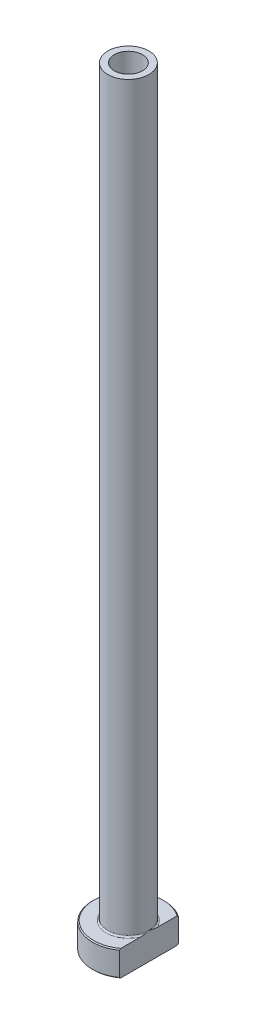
ISO-10303-21;
HEADER;
FILE_DESCRIPTION(('STEP AP214'),'2;1');
FILE_NAME('part.step','',(''),(''),'','','');
FILE_SCHEMA(('AUTOMOTIVE_DESIGN { 1 0 10303 214 1 1 1 1 }'));
ENDSEC;
DATA;
#1=APPLICATION_CONTEXT('core data for automotive mechanical design processes');
#2=APPLICATION_PROTOCOL_DEFINITION('international standard','automotive_design',2000,#1);
#3=PRODUCT_CONTEXT('',#1,'mechanical');
#4=PRODUCT('Part','Part','',(#3));
#5=PRODUCT_RELATED_PRODUCT_CATEGORY('part','',(#4));
#6=PRODUCT_DEFINITION_FORMATION('','',#4);
#7=PRODUCT_DEFINITION_CONTEXT('part definition',#1,'design');
#8=PRODUCT_DEFINITION('design','',#6,#7);
#9=PRODUCT_DEFINITION_SHAPE('','',#8);
#10=(LENGTH_UNIT() NAMED_UNIT(*) SI_UNIT(.MILLI.,.METRE.));
#11=(NAMED_UNIT(*) PLANE_ANGLE_UNIT() SI_UNIT($,.RADIAN.));
#12=(NAMED_UNIT(*) SI_UNIT($,.STERADIAN.) SOLID_ANGLE_UNIT());
#13=UNCERTAINTY_MEASURE_WITH_UNIT(LENGTH_MEASURE(1.E-05),#10,'distance_accuracy_value','');
#14=(GEOMETRIC_REPRESENTATION_CONTEXT(3) GLOBAL_UNCERTAINTY_ASSIGNED_CONTEXT((#13)) GLOBAL_UNIT_ASSIGNED_CONTEXT((#10,
#11,#12)) REPRESENTATION_CONTEXT('',''));
#15=CARTESIAN_POINT('',(0.,0.,0.));
#16=DIRECTION('',(0.,0.,1.));
#17=DIRECTION('',(1.,0.,0.));
#18=AXIS2_PLACEMENT_3D('',#15,#16,#17);
#19=CARTESIAN_POINT('',(0.,92.1876809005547,0.));
#20=DIRECTION('',(0.,1.,0.));
#21=DIRECTION('',(0.,0.,1.));
#22=AXIS2_PLACEMENT_3D('',#19,#20,#21);
#23=CYLINDRICAL_SURFACE('',#22,2.75);
#24=CARTESIAN_POINT('',(0.,150.,0.));
#25=DIRECTION('',(0.,1.,0.));
#26=DIRECTION('',(0.,0.,1.));
#27=AXIS2_PLACEMENT_3D('',#24,#25,#26);
#28=CIRCLE('',#27,2.75);
#29=CARTESIAN_POINT('',(0.,150.,2.75));
#30=VERTEX_POINT('',#29);
#31=EDGE_CURVE('E167',#30,#30,#28,.T.);
#32=ORIENTED_EDGE('',*,*,#31,.T.);
#33=EDGE_LOOP('',(#32));
#34=FACE_BOUND('',#33,.T.);
#35=CARTESIAN_POINT('',(0.,105.,0.));
#36=DIRECTION('',(0.,1.,0.));
#37=DIRECTION('',(0.,0.,1.));
#38=AXIS2_PLACEMENT_3D('',#35,#36,#37);
#39=CIRCLE('',#38,2.75);
#40=CARTESIAN_POINT('',(0.,105.,2.75));
#41=VERTEX_POINT('',#40);
#42=EDGE_CURVE('E170',#41,#41,#39,.T.);
#43=ORIENTED_EDGE('',*,*,#42,.F.);
#44=EDGE_LOOP('',(#43));
#45=FACE_BOUND('',#44,.T.);
#46=ADVANCED_FACE('F32',(#34,#45),#23,.F.);
#47=CARTESIAN_POINT('',(-2.75,150.,0.));
#48=DIRECTION('',(0.,1.,0.));
#49=DIRECTION('',(0.,0.,1.));
#50=AXIS2_PLACEMENT_3D('',#47,#48,#49);
#51=PLANE('',#50);
#52=CARTESIAN_POINT('',(0.,150.,0.));
#53=DIRECTION('',(0.,1.,0.));
#54=DIRECTION('',(0.,0.,1.));
#55=AXIS2_PLACEMENT_3D('',#52,#53,#54);
#56=CIRCLE('',#55,4.00000000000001);
#57=CARTESIAN_POINT('',(0.,150.,4.00000000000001));
#58=VERTEX_POINT('',#57);
#59=EDGE_CURVE('E174',#58,#58,#56,.T.);
#60=ORIENTED_EDGE('',*,*,#59,.T.);
#61=EDGE_LOOP('',(#60));
#62=FACE_BOUND('',#61,.T.);
#63=ORIENTED_EDGE('',*,*,#31,.F.);
#64=EDGE_LOOP('',(#63));
#65=FACE_BOUND('',#64,.T.);
#66=ADVANCED_FACE('F157',(#62,#65),#51,.T.);
#67=CARTESIAN_POINT('',(0.,92.1876809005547,0.));
#68=DIRECTION('',(0.,1.,0.));
#69=DIRECTION('',(0.,0.,1.));
#70=AXIS2_PLACEMENT_3D('',#67,#68,#69);
#71=CYLINDRICAL_SURFACE('',#70,4.);
#72=CARTESIAN_POINT('',(0.,5.3,0.));
#73=DIRECTION('',(0.,1.,0.));
#74=DIRECTION('',(0.,0.,1.));
#75=AXIS2_PLACEMENT_3D('',#72,#73,#74);
#76=CIRCLE('',#75,4.);
#77=CARTESIAN_POINT('',(4.,5.3,0.));
#78=VERTEX_POINT('',#77);
#79=EDGE_CURVE('E180',#78,#78,#76,.T.);
#80=ORIENTED_EDGE('',*,*,#79,.T.);
#81=EDGE_LOOP('',(#80));
#82=FACE_BOUND('',#81,.T.);
#83=ORIENTED_EDGE('',*,*,#59,.F.);
#84=EDGE_LOOP('',(#83));
#85=FACE_BOUND('',#84,.T.);
#86=ADVANCED_FACE('F162',(#82,#85),#71,.T.);
#87=CARTESIAN_POINT('',(-3.99999999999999,5.,0.));
#88=DIRECTION('',(0.,1.,0.));
#89=DIRECTION('',(0.,0.,1.));
#90=AXIS2_PLACEMENT_3D('',#87,#88,#89);
#91=PLANE('',#90);
#92=DIRECTION('',(0.,0.,1.));
#93=VECTOR('',#92,1.);
#94=CARTESIAN_POINT('',(4.,5.,0.));
#95=LINE('',#94,#93);
#96=CARTESIAN_POINT('',(4.,5.,-5.49909083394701));
#97=VERTEX_POINT('',#96);
#98=CARTESIAN_POINT('',(4.,5.,-1.57797338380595));
#99=VERTEX_POINT('',#98);
#100=EDGE_CURVE('E54',#97,#99,#95,.T.);
#101=ORIENTED_EDGE('',*,*,#100,.F.);
#102=CARTESIAN_POINT('',(0.,5.,0.));
#103=DIRECTION('',(0.,1.,0.));
#104=DIRECTION('',(0.,0.,1.));
#105=AXIS2_PLACEMENT_3D('',#102,#103,#104);
#106=CIRCLE('',#105,6.8);
#107=CARTESIAN_POINT('',(3.99999999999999,5.,5.49909083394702));
#108=VERTEX_POINT('',#107);
#109=EDGE_CURVE('E186',#97,#108,#106,.T.);
#110=ORIENTED_EDGE('',*,*,#109,.T.);
#111=CARTESIAN_POINT('',(4.,5.,1.57797338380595));
#112=VERTEX_POINT('',#111);
#113=EDGE_CURVE('E134',#112,#108,#95,.T.);
#114=ORIENTED_EDGE('',*,*,#113,.F.);
#115=CARTESIAN_POINT('',(0.,5.,0.));
#116=DIRECTION('',(0.,1.,0.));
#117=DIRECTION('',(0.,0.,1.));
#118=AXIS2_PLACEMENT_3D('',#115,#116,#117);
#119=CIRCLE('',#118,4.3);
#120=EDGE_CURVE('E183',#112,#99,#119,.F.);
#121=ORIENTED_EDGE('',*,*,#120,.T.);
#122=EDGE_LOOP('',(#101,#110,#114,#121));
#123=FACE_BOUND('',#122,.T.);
#124=ADVANCED_FACE('F197',(#123),#91,.T.);
#125=CARTESIAN_POINT('',(0.,92.1876809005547,0.));
#126=DIRECTION('',(0.,1.,0.));
#127=DIRECTION('',(0.,0.,1.));
#128=AXIS2_PLACEMENT_3D('',#125,#126,#127);
#129=CYLINDRICAL_SURFACE('',#128,6.99999999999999);
#130=DIRECTION('',(0.,-1.,0.));
#131=VECTOR('',#130,1.);
#132=CARTESIAN_POINT('',(3.99999999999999,150.,5.74456264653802));
#133=LINE('',#132,#131);
#134=CARTESIAN_POINT('',(3.99999999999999,4.8,5.74456264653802));
#135=VERTEX_POINT('',#134);
#136=CARTESIAN_POINT('',(3.99999999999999,0.200000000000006,5.74456264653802));
#137=VERTEX_POINT('',#136);
#138=EDGE_CURVE('E82',#135,#137,#133,.T.);
#139=ORIENTED_EDGE('',*,*,#138,.F.);
#140=CARTESIAN_POINT('',(0.,4.8,0.));
#141=DIRECTION('',(0.,1.,0.));
#142=DIRECTION('',(0.,0.,1.));
#143=AXIS2_PLACEMENT_3D('',#140,#141,#142);
#144=CIRCLE('',#143,6.99999999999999);
#145=CARTESIAN_POINT('',(4.,4.8,-5.74456264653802));
#146=VERTEX_POINT('',#145);
#147=EDGE_CURVE('E95',#135,#146,#144,.F.);
#148=ORIENTED_EDGE('',*,*,#147,.T.);
#149=DIRECTION('',(0.,-1.,0.));
#150=VECTOR('',#149,1.);
#151=CARTESIAN_POINT('',(4.,150.,-5.74456264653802));
#152=LINE('',#151,#150);
#153=CARTESIAN_POINT('',(4.,0.200000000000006,-5.74456264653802));
#154=VERTEX_POINT('',#153);
#155=EDGE_CURVE('E192',#146,#154,#152,.T.);
#156=ORIENTED_EDGE('',*,*,#155,.T.);
#157=CARTESIAN_POINT('',(0.,0.200000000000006,0.));
#158=DIRECTION('',(0.,-1.,0.));
#159=DIRECTION('',(0.,0.,-1.));
#160=AXIS2_PLACEMENT_3D('',#157,#158,#159);
#161=CIRCLE('',#160,6.99999999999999);
#162=EDGE_CURVE('E98',#154,#137,#161,.F.);
#163=ORIENTED_EDGE('',*,*,#162,.T.);
#164=EDGE_LOOP('',(#139,#148,#156,#163));
#165=FACE_BOUND('',#164,.T.);
#166=ADVANCED_FACE('F190',(#165),#129,.T.);
#167=CARTESIAN_POINT('',(-6.99999999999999,0.,0.));
#168=DIRECTION('',(0.,-1.,0.));
#169=DIRECTION('',(0.,0.,-1.));
#170=AXIS2_PLACEMENT_3D('',#167,#168,#169);
#171=PLANE('',#170);
#172=CARTESIAN_POINT('',(0.,0.,0.));
#173=DIRECTION('',(0.,-1.,0.));
#174=DIRECTION('',(0.,0.,-1.));
#175=AXIS2_PLACEMENT_3D('',#172,#173,#174);
#176=CIRCLE('',#175,3.49999999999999);
#177=CARTESIAN_POINT('',(0.,0.,-3.49999999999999));
#178=VERTEX_POINT('',#177);
#179=EDGE_CURVE('E40',#178,#178,#176,.F.);
#180=ORIENTED_EDGE('',*,*,#179,.T.);
#181=EDGE_LOOP('',(#180));
#182=FACE_BOUND('',#181,.T.);
#183=DIRECTION('',(0.,0.,-1.));
#184=VECTOR('',#183,1.);
#185=CARTESIAN_POINT('',(3.99999999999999,0.,5.74456264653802));
#186=LINE('',#185,#184);
#187=CARTESIAN_POINT('',(3.99999999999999,0.,5.49909083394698));
#188=VERTEX_POINT('',#187);
#189=CARTESIAN_POINT('',(4.,0.,-5.49909083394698));
#190=VERTEX_POINT('',#189);
#191=EDGE_CURVE('E47',#188,#190,#186,.T.);
#192=ORIENTED_EDGE('',*,*,#191,.F.);
#193=CARTESIAN_POINT('',(0.,0.,0.));
#194=DIRECTION('',(0.,-1.,0.));
#195=DIRECTION('',(0.,0.,-1.));
#196=AXIS2_PLACEMENT_3D('',#193,#194,#195);
#197=CIRCLE('',#196,6.79999999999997);
#198=EDGE_CURVE('E92',#188,#190,#197,.T.);
#199=ORIENTED_EDGE('',*,*,#198,.T.);
#200=EDGE_LOOP('',(#192,#199));
#201=FACE_BOUND('',#200,.T.);
#202=ADVANCED_FACE('F91',(#182,#201),#171,.T.);
#203=CARTESIAN_POINT('',(0.,92.1876809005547,0.));
#204=DIRECTION('',(0.,1.,0.));
#205=DIRECTION('',(0.,0.,1.));
#206=AXIS2_PLACEMENT_3D('',#203,#204,#205);
#207=CYLINDRICAL_SURFACE('',#206,3.);
#208=CARTESIAN_POINT('',(0.,0.499999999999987,0.));
#209=DIRECTION('',(0.,-1.,0.));
#210=DIRECTION('',(0.,0.,-1.));
#211=AXIS2_PLACEMENT_3D('',#208,#209,#210);
#212=CIRCLE('',#211,3.);
#213=CARTESIAN_POINT('',(0.,0.499999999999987,-3.));
#214=VERTEX_POINT('',#213);
#215=EDGE_CURVE('E11',#214,#214,#212,.T.);
#216=ORIENTED_EDGE('',*,*,#215,.T.);
#217=EDGE_LOOP('',(#216));
#218=FACE_BOUND('',#217,.T.);
#219=CARTESIAN_POINT('',(0.,93.,0.));
#220=DIRECTION('',(0.,1.,0.));
#221=DIRECTION('',(0.,0.,1.));
#222=AXIS2_PLACEMENT_3D('',#219,#220,#221);
#223=CIRCLE('',#222,3.);
#224=CARTESIAN_POINT('',(0.,93.,3.));
#225=VERTEX_POINT('',#224);
#226=EDGE_CURVE('E172',#225,#225,#223,.T.);
#227=ORIENTED_EDGE('',*,*,#226,.T.);
#228=EDGE_LOOP('',(#227));
#229=FACE_BOUND('',#228,.T.);
#230=ADVANCED_FACE('F215',(#218,#229),#207,.F.);
#231=CARTESIAN_POINT('',(0.,93.,0.));
#232=DIRECTION('',(0.,-1.,0.));
#233=DIRECTION('',(0.,0.,-1.));
#234=AXIS2_PLACEMENT_3D('',#231,#232,#233);
#235=CONICAL_SURFACE('',#234,3.,0.0208303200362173);
#236=ORIENTED_EDGE('',*,*,#42,.T.);
#237=EDGE_LOOP('',(#236));
#238=FACE_BOUND('',#237,.T.);
#239=ORIENTED_EDGE('',*,*,#226,.F.);
#240=EDGE_LOOP('',(#239));
#241=FACE_BOUND('',#240,.T.);
#242=ADVANCED_FACE('F111',(#238,#241),#235,.F.);
#243=CARTESIAN_POINT('',(0.,5.3,0.));
#244=DIRECTION('',(0.,1.,0.));
#245=DIRECTION('',(0.,0.,1.));
#246=AXIS2_PLACEMENT_3D('',#243,#244,#245);
#247=TOROIDAL_SURFACE('',#246,4.3,0.3);
#248=ORIENTED_EDGE('',*,*,#120,.F.);
#249=CARTESIAN_POINT('',(4.,5.3,0.));
#250=CARTESIAN_POINT('',(4.,5.3000006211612,-1.06261408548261E-10));
#251=CARTESIAN_POINT('',(4.,5.30000124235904,2.17726046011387E-07));
#252=CARTESIAN_POINT('',(4.,5.30000240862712,8.3614095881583E-07));
#253=CARTESIAN_POINT('',(4.,5.30000294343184,1.25011675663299E-06));
#254=CARTESIAN_POINT('',(4.,5.30000404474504,2.23959330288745E-06));
#255=CARTESIAN_POINT('',(4.,5.30000459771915,2.83084453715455E-06));
#256=CARTESIAN_POINT('',(4.,5.30000559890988,4.06516593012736E-06));
#257=CARTESIAN_POINT('',(4.,5.30000604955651,4.70640072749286E-06));
#258=CARTESIAN_POINT('',(4.,5.30000769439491,7.15677192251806E-06));
#259=CARTESIAN_POINT('',(4.,5.30000879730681,9.02995955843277E-06));
#260=CARTESIAN_POINT('',(4.,5.3000106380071,1.27664884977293E-05));
#261=CARTESIAN_POINT('',(4.,5.30001139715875,1.46197804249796E-05));
#262=CARTESIAN_POINT('',(4.,5.30001453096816,2.23679219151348E-05));
#263=CARTESIAN_POINT('',(4.,5.30001683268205,2.82968746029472E-05));
#264=CARTESIAN_POINT('',(4.,5.30002027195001,3.95668726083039E-05));
#265=CARTESIAN_POINT('',(4.,5.30002152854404,4.48715457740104E-05));
#266=CARTESIAN_POINT('',(4.,5.30003060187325,8.40118194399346E-05));
#267=CARTESIAN_POINT('',(4.,5.30003739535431,0.00011802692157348));
#268=CARTESIAN_POINT('',(3.99999999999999,5.30006713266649,0.000252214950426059));
#269=CARTESIAN_POINT('',(4.,5.30009559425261,0.000351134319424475));
#270=CARTESIAN_POINT('',(4.,5.30020622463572,0.000742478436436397));
#271=CARTESIAN_POINT('',(4.,5.30028475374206,0.00103561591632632));
#272=CARTESIAN_POINT('',(3.99999999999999,5.30059889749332,0.0021992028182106));
#273=CARTESIAN_POINT('',(3.99999999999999,5.30083905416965,0.00306873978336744));
#274=CARTESIAN_POINT('',(4.,5.30183682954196,0.0066914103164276));
#275=CARTESIAN_POINT('',(4.,5.30258877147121,0.00944568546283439));
#276=CARTESIAN_POINT('',(3.99999999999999,5.31066890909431,0.039029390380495));
#277=CARTESIAN_POINT('',(3.99999999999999,5.31802631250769,0.0658531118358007));
#278=CARTESIAN_POINT('',(4.,5.33239676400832,0.118441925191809));
#279=CARTESIAN_POINT('',(4.,5.3394118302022,0.144206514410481));
#280=CARTESIAN_POINT('',(3.99999999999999,5.35427366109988,0.199017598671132));
#281=CARTESIAN_POINT('',(4.,5.36211313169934,0.228066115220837));
#282=CARTESIAN_POINT('',(4.,5.37776349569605,0.286511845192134));
#283=CARTESIAN_POINT('',(4.,5.38557313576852,0.315909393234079));
#284=CARTESIAN_POINT('',(4.,5.40425662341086,0.386994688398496));
#285=CARTESIAN_POINT('',(4.,5.41505237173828,0.428703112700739));
#286=CARTESIAN_POINT('',(4.,5.43592310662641,0.511098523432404));
#287=CARTESIAN_POINT('',(4.,5.44600969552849,0.551782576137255));
#288=CARTESIAN_POINT('',(4.,5.47850986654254,0.686599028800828));
#289=CARTESIAN_POINT('',(4.,5.49978370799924,0.78101186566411));
#290=CARTESIAN_POINT('',(4.,5.53807543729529,0.971847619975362));
#291=CARTESIAN_POINT('',(4.,5.55504273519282,1.06828120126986));
#292=CARTESIAN_POINT('',(4.,5.57582405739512,1.21752725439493));
#293=CARTESIAN_POINT('',(4.,5.58209796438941,1.26999379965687));
#294=CARTESIAN_POINT('',(4.,5.59210686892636,1.37516324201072));
#295=CARTESIAN_POINT('',(4.,5.59584265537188,1.42786606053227));
#296=CARTESIAN_POINT('',(4.,5.60010438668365,1.5331067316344));
#297=CARTESIAN_POINT('',(4.,5.6006487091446,1.58564378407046));
#298=CARTESIAN_POINT('',(4.,5.59767158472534,1.69058605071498));
#299=CARTESIAN_POINT('',(4.,5.59415502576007,1.74299134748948));
#300=CARTESIAN_POINT('',(4.,5.5850306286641,1.81903290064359));
#301=CARTESIAN_POINT('',(4.,5.58157617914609,1.84292934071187));
#302=CARTESIAN_POINT('',(4.,5.57329952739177,1.89051061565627));
#303=CARTESIAN_POINT('',(4.,5.5684761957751,1.91419525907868));
#304=CARTESIAN_POINT('',(4.,5.55726644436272,1.96092888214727));
#305=CARTESIAN_POINT('',(4.,5.55089740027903,1.98398195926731));
#306=CARTESIAN_POINT('',(4.,5.53623434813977,2.02945550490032));
#307=CARTESIAN_POINT('',(4.,5.52794253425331,2.05187666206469));
#308=CARTESIAN_POINT('',(4.,5.5088709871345,2.09590631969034));
#309=CARTESIAN_POINT('',(4.,5.49806837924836,2.11750508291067));
#310=CARTESIAN_POINT('',(4.,5.47333401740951,2.15885583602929));
#311=CARTESIAN_POINT('',(4.,5.45941272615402,2.17861369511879));
#312=CARTESIAN_POINT('',(4.,5.43588221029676,2.20522942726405));
#313=CARTESIAN_POINT('',(4.,5.42781139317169,2.21344043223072));
#314=CARTESIAN_POINT('',(4.,5.41065114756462,2.22875149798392));
#315=CARTESIAN_POINT('',(4.,5.40156129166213,2.23585108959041));
#316=CARTESIAN_POINT('',(4.,5.38220524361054,2.24859694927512));
#317=CARTESIAN_POINT('',(4.,5.37192420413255,2.25422119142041));
#318=CARTESIAN_POINT('',(4.,5.35045072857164,2.26331064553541));
#319=CARTESIAN_POINT('',(4.,5.33926122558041,2.26678251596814));
#320=CARTESIAN_POINT('',(4.,5.31952044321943,2.27051268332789));
#321=CARTESIAN_POINT('',(4.,5.31108453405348,2.27139016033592));
#322=CARTESIAN_POINT('',(4.,5.29418624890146,2.27168963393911));
#323=CARTESIAN_POINT('',(4.,5.28572387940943,2.27111196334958));
#324=CARTESIAN_POINT('',(4.,5.26904138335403,2.26855580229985));
#325=CARTESIAN_POINT('',(4.,5.26082066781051,2.26658107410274));
#326=CARTESIAN_POINT('',(4.,5.24478214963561,2.26139496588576));
#327=CARTESIAN_POINT('',(4.,5.23696461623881,2.25818277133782));
#328=CARTESIAN_POINT('',(4.,5.21851235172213,2.24908332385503));
#329=CARTESIAN_POINT('',(4.,5.20815219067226,2.24264095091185));
#330=CARTESIAN_POINT('',(4.,5.18857975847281,2.22819957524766));
#331=CARTESIAN_POINT('',(4.,5.17937061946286,2.22019647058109));
#332=CARTESIAN_POINT('',(4.,5.15665383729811,2.19777756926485));
#333=CARTESIAN_POINT('',(4.,5.1440348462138,2.18246908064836));
#334=CARTESIAN_POINT('',(4.,5.1211836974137,2.15020843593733));
#335=CARTESIAN_POINT('',(4.,5.11095480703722,2.13325407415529));
#336=CARTESIAN_POINT('',(4.,5.09273574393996,2.0989232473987));
#337=CARTESIAN_POINT('',(4.,5.0846821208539,2.08157988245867));
#338=CARTESIAN_POINT('',(4.,5.0700590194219,2.0462707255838));
#339=CARTESIAN_POINT('',(4.,5.06349101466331,2.02830433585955));
#340=CARTESIAN_POINT('',(4.,5.04555485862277,1.97350761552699));
#341=CARTESIAN_POINT('',(4.,5.03608974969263,1.93605770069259));
#342=CARTESIAN_POINT('',(4.,5.01780569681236,1.84529235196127));
#343=CARTESIAN_POINT('',(4.,5.01077018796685,1.79164082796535));
#344=CARTESIAN_POINT('',(4.,5.00182846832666,1.68379947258));
#345=CARTESIAN_POINT('',(4.,4.9999388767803,1.62960846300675));
#346=CARTESIAN_POINT('',(4.,5.00006129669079,1.52361204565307));
#347=CARTESIAN_POINT('',(4.,5.00190698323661,1.47180551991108));
#348=CARTESIAN_POINT('',(4.,5.00841243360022,1.36835357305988));
#349=CARTESIAN_POINT('',(4.,5.01307376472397,1.31670825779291));
#350=CARTESIAN_POINT('',(4.,5.02905484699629,1.17431887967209));
#351=CARTESIAN_POINT('',(4.,5.04274090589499,1.08384207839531));
#352=CARTESIAN_POINT('',(4.,5.06701714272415,0.94775795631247));
#353=CARTESIAN_POINT('',(4.,5.0758557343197,0.901814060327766));
#354=CARTESIAN_POINT('',(4.,5.09458665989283,0.810008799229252));
#355=CARTESIAN_POINT('',(4.,5.10448180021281,0.764148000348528));
#356=CARTESIAN_POINT('',(4.,5.12892434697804,0.655631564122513));
#357=CARTESIAN_POINT('',(4.,5.14383556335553,0.593058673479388));
#358=CARTESIAN_POINT('',(4.,5.17458762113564,0.468885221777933));
#359=CARTESIAN_POINT('',(3.99999999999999,5.19041623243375,0.407281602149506));
#360=CARTESIAN_POINT('',(4.,5.22090834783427,0.291232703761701));
#361=CARTESIAN_POINT('',(4.,5.23550024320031,0.236768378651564));
#362=CARTESIAN_POINT('',(3.99999999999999,5.26562550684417,0.125604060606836));
#363=CARTESIAN_POINT('',(3.99999999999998,5.28117250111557,0.0689076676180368));
#364=CARTESIAN_POINT('',(4.,5.29741226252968,0.00944154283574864));
#365=CARTESIAN_POINT('',(4.,5.29816540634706,0.00668315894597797));
#366=CARTESIAN_POINT('',(3.99999999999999,5.29916346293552,0.00305954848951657));
#367=CARTESIAN_POINT('',(3.99999999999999,5.29940273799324,0.00219318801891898));
#368=CARTESIAN_POINT('',(4.,5.29971580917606,0.00103357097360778));
#369=CARTESIAN_POINT('',(4.,5.29979412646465,0.000741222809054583));
#370=CARTESIAN_POINT('',(4.,5.29990450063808,0.000350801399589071));
#371=CARTESIAN_POINT('',(3.99999999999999,5.29993292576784,0.000252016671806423));
#372=CARTESIAN_POINT('',(4.,5.29996263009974,0.000117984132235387));
#373=CARTESIAN_POINT('',(4.,5.29996941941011,8.39881887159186E-05));
#374=CARTESIAN_POINT('',(4.,5.29997848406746,4.4867400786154E-05));
#375=CARTESIAN_POINT('',(4.,5.2999797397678,3.95638181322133E-05));
#376=CARTESIAN_POINT('',(4.,5.29998317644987,2.82960330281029E-05));
#377=CARTESIAN_POINT('',(4.,5.29998547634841,2.23681449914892E-05));
#378=CARTESIAN_POINT('',(4.,5.29998860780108,1.46210997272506E-05));
#379=CARTESIAN_POINT('',(4.,5.29998936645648,1.27678895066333E-05));
#380=CARTESIAN_POINT('',(4.,5.29999120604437,9.03144008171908E-06));
#381=CARTESIAN_POINT('',(4.,5.29999230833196,7.15824051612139E-06));
#382=CARTESIAN_POINT('',(4.,5.29999395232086,4.70775500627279E-06));
#383=CARTESIAN_POINT('',(4.,5.29999440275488,4.06646363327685E-06));
#384=CARTESIAN_POINT('',(4.,5.29999540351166,2.83199071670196E-06));
#385=CARTESIAN_POINT('',(4.,5.29999595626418,2.24064331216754E-06));
#386=CARTESIAN_POINT('',(4.,5.29999705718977,1.25093964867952E-06));
#387=CARTESIAN_POINT('',(4.,5.29999759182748,8.36841013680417E-07));
#388=CARTESIAN_POINT('',(4.,5.29999875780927,2.1811772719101E-07));
#389=CARTESIAN_POINT('',(4.,5.29999937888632,1.06254485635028E-10));
#390=CARTESIAN_POINT('',(4.,5.3,0.));
#391=B_SPLINE_CURVE_WITH_KNOTS('',3,(#249,#250,#251,#252,#253,#254,#255,#256,#257,#258,#259,
#260,#261,#262,#263,#264,#265,#266,#267,#268,#269,#270,#271,#272,#273,#274,#275,#276,#277,#278,
#279,#280,#281,#282,#283,#284,#285,#286,#287,#288,#289,#290,#291,#292,#293,#294,#295,#296,#297,
#298,#299,#300,#301,#302,#303,#304,#305,#306,#307,#308,#309,#310,#311,#312,#313,#314,#315,#316,
#317,#318,#319,#320,#321,#322,#323,#324,#325,#326,#327,#328,#329,#330,#331,#332,#333,#334,#335,
#336,#337,#338,#339,#340,#341,#342,#343,#344,#345,#346,#347,#348,#349,#350,#351,#352,#353,#354,
#355,#356,#357,#358,#359,#360,#361,#362,#363,#364,#365,#366,#367,#368,#369,#370,#371,#372,#373,
#374,#375,#376,#377,#378,#379,#380,#381,#382,#383,#384,#385,#386,#387,#388,#389,#390),
.UNSPECIFIED.,.T.,.F.,(4,2,2,2,2,2,2,2,2,2,2,2,2,2,2,2,2,2,2,2,2,2,2,2,2,2,2,2,2,2,2,2,2,2,2,2,
2,2,2,2,2,2,2,2,2,2,2,2,2,2,2,2,2,2,2,2,2,2,2,2,2,2,2,2,2,2,2,2,2,2,4),(0.,1.87484466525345E-06,
3.90180119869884E-06,6.31683969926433E-06,8.66652145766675E-06,1.51627575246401E-05,
2.11657959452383E-05,4.0209080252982E-05,5.654295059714E-05,0.000160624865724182,
0.000469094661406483,0.00137985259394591,0.00408571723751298,0.0126514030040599,
0.0960918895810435,0.17620014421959,0.26646304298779,0.357714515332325,0.486961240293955,
0.612707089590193,0.90298810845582,1.1965358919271,1.35501075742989,1.51343634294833,
1.67094875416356,1.82827177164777,1.90067591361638,1.97313996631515,2.04482437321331,
2.11642737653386,2.1887102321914,2.26075412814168,2.29521947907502,2.32969934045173,
2.36466792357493,2.39952778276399,2.42485422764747,2.45017488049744,2.47542760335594,
2.50069697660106,2.53708899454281,2.57357798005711,2.63276032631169,2.69202310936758,
2.7493031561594,2.80663977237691,2.92223125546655,3.08420752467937,3.24670629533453,
3.40212850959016,3.55763731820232,3.83192962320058,3.97228382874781,4.11302057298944,
4.3059813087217,4.49678885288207,4.66594443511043,4.84230602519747,4.85088453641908,
4.85358051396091,4.85448881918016,4.85479687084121,4.85490089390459,4.85491722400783,
4.85493626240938,4.85494226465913,4.85494875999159,4.85495110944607,4.85495352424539,
4.85495555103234,4.85495742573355),.UNSPECIFIED.);
#392=EDGE_CURVE('E126',#112,#78,#391,.T.);
#393=ORIENTED_EDGE('',*,*,#392,.T.);
#394=ORIENTED_EDGE('',*,*,#79,.F.);
#395=CARTESIAN_POINT('',(4.,5.3,0.));
#396=CARTESIAN_POINT('',(4.,5.29999937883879,1.06262613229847E-10));
#397=CARTESIAN_POINT('',(4.,5.29999875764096,-2.17726044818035E-07));
#398=CARTESIAN_POINT('',(4.,5.29999759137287,-8.36140957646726E-07));
#399=CARTESIAN_POINT('',(4.,5.29999705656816,-1.25011675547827E-06));
#400=CARTESIAN_POINT('',(4.,5.29999595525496,-2.23959330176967E-06));
#401=CARTESIAN_POINT('',(4.,5.29999540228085,-2.83084453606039E-06));
#402=CARTESIAN_POINT('',(4.,5.29999440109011,-4.06516592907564E-06));
#403=CARTESIAN_POINT('',(4.,5.29999395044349,-4.70640072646E-06));
#404=CARTESIAN_POINT('',(4.,5.29999230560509,-7.15677192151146E-06));
#405=CARTESIAN_POINT('',(4.,5.29999120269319,-9.02995955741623E-06));
#406=CARTESIAN_POINT('',(4.,5.2999893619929,-1.27664884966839E-05));
#407=CARTESIAN_POINT('',(4.,5.29998860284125,-1.46197804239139E-05));
#408=CARTESIAN_POINT('',(4.,5.29998546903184,-2.23679219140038E-05));
#409=CARTESIAN_POINT('',(4.,5.29998316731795,-2.82968746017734E-05));
#410=CARTESIAN_POINT('',(4.,5.29997972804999,-3.95668726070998E-05));
#411=CARTESIAN_POINT('',(4.,5.29997847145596,-4.48715457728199E-05));
#412=CARTESIAN_POINT('',(4.,5.29996939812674,-8.40118194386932E-05));
#413=CARTESIAN_POINT('',(4.,5.29996260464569,-0.000118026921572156));
#414=CARTESIAN_POINT('',(3.99999999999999,5.29993286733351,-0.000252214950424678));
#415=CARTESIAN_POINT('',(4.,5.29990440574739,-0.000351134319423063));
#416=CARTESIAN_POINT('',(4.,5.29979377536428,-0.000742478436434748));
#417=CARTESIAN_POINT('',(4.,5.29971524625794,-0.00103561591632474));
#418=CARTESIAN_POINT('',(3.99999999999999,5.29940110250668,-0.00219920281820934));
#419=CARTESIAN_POINT('',(3.99999999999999,5.29916094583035,-0.0030687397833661));
#420=CARTESIAN_POINT('',(4.,5.29816317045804,-0.00669141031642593));
#421=CARTESIAN_POINT('',(4.,5.29741122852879,-0.00944568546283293));
#422=CARTESIAN_POINT('',(3.99999999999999,5.28933109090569,-0.0390293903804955));
#423=CARTESIAN_POINT('',(3.99999999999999,5.28197368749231,-0.0658531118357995));
#424=CARTESIAN_POINT('',(4.,5.26760323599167,-0.118441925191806));
#425=CARTESIAN_POINT('',(4.,5.26058816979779,-0.144206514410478));
#426=CARTESIAN_POINT('',(3.99999999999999,5.24572633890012,-0.199017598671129));
#427=CARTESIAN_POINT('',(4.,5.23788686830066,-0.228066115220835));
#428=CARTESIAN_POINT('',(4.,5.22223650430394,-0.286511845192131));
#429=CARTESIAN_POINT('',(4.,5.21442686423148,-0.315909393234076));
#430=CARTESIAN_POINT('',(4.,5.19574337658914,-0.386994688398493));
#431=CARTESIAN_POINT('',(4.,5.18494762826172,-0.428703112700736));
#432=CARTESIAN_POINT('',(4.,5.16407689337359,-0.511098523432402));
#433=CARTESIAN_POINT('',(4.,5.15399030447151,-0.551782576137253));
#434=CARTESIAN_POINT('',(4.,5.12149013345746,-0.686599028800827));
#435=CARTESIAN_POINT('',(4.,5.10021629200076,-0.781011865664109));
#436=CARTESIAN_POINT('',(4.,5.06192456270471,-0.971847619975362));
#437=CARTESIAN_POINT('',(4.,5.04495726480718,-1.06828120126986));
#438=CARTESIAN_POINT('',(4.,5.02417594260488,-1.21752725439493));
#439=CARTESIAN_POINT('',(4.,5.01790203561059,-1.26999379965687));
#440=CARTESIAN_POINT('',(4.,5.00789313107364,-1.37516324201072));
#441=CARTESIAN_POINT('',(4.,5.00415734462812,-1.42786606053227));
#442=CARTESIAN_POINT('',(4.,4.99989561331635,-1.5331067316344));
#443=CARTESIAN_POINT('',(4.,4.9993512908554,-1.58564378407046));
#444=CARTESIAN_POINT('',(4.,5.00232841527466,-1.69058605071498));
#445=CARTESIAN_POINT('',(4.,5.00584497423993,-1.74299134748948));
#446=CARTESIAN_POINT('',(4.,5.01496937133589,-1.81903290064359));
#447=CARTESIAN_POINT('',(4.,5.01842382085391,-1.84292934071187));
#448=CARTESIAN_POINT('',(4.,5.02670047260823,-1.89051061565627));
#449=CARTESIAN_POINT('',(4.,5.0315238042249,-1.91419525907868));
#450=CARTESIAN_POINT('',(4.,5.04273355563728,-1.96092888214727));
#451=CARTESIAN_POINT('',(4.,5.04910259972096,-1.98398195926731));
#452=CARTESIAN_POINT('',(4.,5.06376565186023,-2.02945550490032));
#453=CARTESIAN_POINT('',(4.,5.07205746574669,-2.05187666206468));
#454=CARTESIAN_POINT('',(4.,5.09112901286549,-2.09590631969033));
#455=CARTESIAN_POINT('',(4.,5.10193162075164,-2.11750508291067));
#456=CARTESIAN_POINT('',(4.,5.12666598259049,-2.15885583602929));
#457=CARTESIAN_POINT('',(4.,5.14058727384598,-2.17861369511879));
#458=CARTESIAN_POINT('',(4.,5.16411778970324,-2.20522942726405));
#459=CARTESIAN_POINT('',(4.,5.17218860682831,-2.21344043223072));
#460=CARTESIAN_POINT('',(4.,5.18934885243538,-2.22875149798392));
#461=CARTESIAN_POINT('',(4.,5.19843870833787,-2.23585108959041));
#462=CARTESIAN_POINT('',(4.,5.21779475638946,-2.24859694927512));
#463=CARTESIAN_POINT('',(4.,5.22807579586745,-2.25422119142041));
#464=CARTESIAN_POINT('',(4.,5.24954927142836,-2.26331064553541));
#465=CARTESIAN_POINT('',(4.,5.26073877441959,-2.26678251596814));
#466=CARTESIAN_POINT('',(4.,5.28047955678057,-2.27051268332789));
#467=CARTESIAN_POINT('',(4.,5.28891546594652,-2.27139016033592));
#468=CARTESIAN_POINT('',(4.,5.30581375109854,-2.2716896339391));
#469=CARTESIAN_POINT('',(4.,5.31427612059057,-2.27111196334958));
#470=CARTESIAN_POINT('',(4.,5.33095861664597,-2.26855580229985));
#471=CARTESIAN_POINT('',(4.,5.33917933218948,-2.26658107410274));
#472=CARTESIAN_POINT('',(4.,5.35521785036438,-2.26139496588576));
#473=CARTESIAN_POINT('',(4.,5.36303538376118,-2.25818277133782));
#474=CARTESIAN_POINT('',(4.,5.38148764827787,-2.24908332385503));
#475=CARTESIAN_POINT('',(4.,5.39184780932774,-2.24264095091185));
#476=CARTESIAN_POINT('',(4.,5.41142024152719,-2.22819957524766));
#477=CARTESIAN_POINT('',(4.,5.42062938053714,-2.22019647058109));
#478=CARTESIAN_POINT('',(4.,5.44334616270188,-2.19777756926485));
#479=CARTESIAN_POINT('',(4.,5.4559651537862,-2.18246908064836));
#480=CARTESIAN_POINT('',(4.,5.4788163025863,-2.15020843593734));
#481=CARTESIAN_POINT('',(4.,5.48904519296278,-2.13325407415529));
#482=CARTESIAN_POINT('',(4.,5.50726425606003,-2.0989232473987));
#483=CARTESIAN_POINT('',(4.,5.5153178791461,-2.08157988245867));
#484=CARTESIAN_POINT('',(4.,5.5299409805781,-2.0462707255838));
#485=CARTESIAN_POINT('',(4.,5.53650898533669,-2.02830433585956));
#486=CARTESIAN_POINT('',(4.,5.55444514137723,-1.973507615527));
#487=CARTESIAN_POINT('',(4.,5.56391025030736,-1.9360577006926));
#488=CARTESIAN_POINT('',(4.,5.58219430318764,-1.84529235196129));
#489=CARTESIAN_POINT('',(4.,5.58922981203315,-1.79164082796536));
#490=CARTESIAN_POINT('',(4.,5.59817153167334,-1.68379947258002));
#491=CARTESIAN_POINT('',(4.,5.6000611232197,-1.62960846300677));
#492=CARTESIAN_POINT('',(4.,5.59993870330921,-1.52361204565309));
#493=CARTESIAN_POINT('',(4.,5.59809301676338,-1.47180551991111));
#494=CARTESIAN_POINT('',(4.,5.59158756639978,-1.3683535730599));
#495=CARTESIAN_POINT('',(4.,5.58692623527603,-1.31670825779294));
#496=CARTESIAN_POINT('',(4.,5.57094515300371,-1.17431887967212));
#497=CARTESIAN_POINT('',(4.,5.55725909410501,-1.08384207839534));
#498=CARTESIAN_POINT('',(4.,5.53298285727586,-0.947757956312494));
#499=CARTESIAN_POINT('',(4.,5.5241442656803,-0.901814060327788));
#500=CARTESIAN_POINT('',(4.,5.50541334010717,-0.810008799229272));
#501=CARTESIAN_POINT('',(4.,5.49551819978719,-0.764148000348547));
#502=CARTESIAN_POINT('',(4.,5.47107565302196,-0.65563156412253));
#503=CARTESIAN_POINT('',(4.,5.45616443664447,-0.593058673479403));
#504=CARTESIAN_POINT('',(4.,5.42541237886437,-0.468885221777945));
#505=CARTESIAN_POINT('',(3.99999999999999,5.40958376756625,-0.407281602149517));
#506=CARTESIAN_POINT('',(4.,5.37909165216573,-0.291232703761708));
#507=CARTESIAN_POINT('',(4.,5.36449975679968,-0.23676837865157));
#508=CARTESIAN_POINT('',(3.99999999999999,5.33437449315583,-0.125604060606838));
#509=CARTESIAN_POINT('',(3.99999999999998,5.31882749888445,-0.0689076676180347));
#510=CARTESIAN_POINT('',(4.,5.30258773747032,-0.00944154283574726));
#511=CARTESIAN_POINT('',(4.,5.30183459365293,-0.00668315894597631));
#512=CARTESIAN_POINT('',(3.99999999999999,5.30083653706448,-0.00305954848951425));
#513=CARTESIAN_POINT('',(3.99999999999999,5.30059726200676,-0.0021931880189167));
#514=CARTESIAN_POINT('',(4.,5.30028419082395,-0.00103357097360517));
#515=CARTESIAN_POINT('',(4.,5.30020587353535,-0.000741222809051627));
#516=CARTESIAN_POINT('',(4.,5.30009549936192,-0.000350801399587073));
#517=CARTESIAN_POINT('',(3.99999999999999,5.30006707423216,-0.000252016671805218));
#518=CARTESIAN_POINT('',(4.,5.30003736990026,-0.000117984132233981));
#519=CARTESIAN_POINT('',(4.,5.30003058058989,-8.39881887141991E-05));
#520=CARTESIAN_POINT('',(4.,5.30002151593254,-4.48674007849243E-05));
#521=CARTESIAN_POINT('',(4.,5.3000202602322,-3.95638181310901E-05));
#522=CARTESIAN_POINT('',(4.,5.30001682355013,-2.82960330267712E-05));
#523=CARTESIAN_POINT('',(4.,5.30001452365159,-2.23681449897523E-05));
#524=CARTESIAN_POINT('',(4.,5.30001139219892,-1.46210997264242E-05));
#525=CARTESIAN_POINT('',(4.,5.30001063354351,-1.27678895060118E-05));
#526=CARTESIAN_POINT('',(4.,5.30000879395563,-9.03144008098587E-06));
#527=CARTESIAN_POINT('',(4.,5.30000769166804,-7.15824051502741E-06));
#528=CARTESIAN_POINT('',(4.,5.30000604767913,-4.70775500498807E-06));
#529=CARTESIAN_POINT('',(4.,5.30000559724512,-4.06646363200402E-06));
#530=CARTESIAN_POINT('',(4.,5.30000459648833,-2.83199071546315E-06));
#531=CARTESIAN_POINT('',(4.,5.30000404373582,-2.24064331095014E-06));
#532=CARTESIAN_POINT('',(4.,5.30000294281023,-1.25093964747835E-06));
#533=CARTESIAN_POINT('',(4.,5.30000240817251,-8.36841012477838E-07));
#534=CARTESIAN_POINT('',(4.,5.30000124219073,-2.18117725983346E-07));
#535=CARTESIAN_POINT('',(4.,5.30000062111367,-1.06253274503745E-10));
#536=CARTESIAN_POINT('',(4.,5.3,0.));
#537=B_SPLINE_CURVE_WITH_KNOTS('',3,(#395,#396,#397,#398,#399,#400,#401,#402,#403,#404,#405,
#406,#407,#408,#409,#410,#411,#412,#413,#414,#415,#416,#417,#418,#419,#420,#421,#422,#423,#424,
#425,#426,#427,#428,#429,#430,#431,#432,#433,#434,#435,#436,#437,#438,#439,#440,#441,#442,#443,
#444,#445,#446,#447,#448,#449,#450,#451,#452,#453,#454,#455,#456,#457,#458,#459,#460,#461,#462,
#463,#464,#465,#466,#467,#468,#469,#470,#471,#472,#473,#474,#475,#476,#477,#478,#479,#480,#481,
#482,#483,#484,#485,#486,#487,#488,#489,#490,#491,#492,#493,#494,#495,#496,#497,#498,#499,#500,
#501,#502,#503,#504,#505,#506,#507,#508,#509,#510,#511,#512,#513,#514,#515,#516,#517,#518,#519,
#520,#521,#522,#523,#524,#525,#526,#527,#528,#529,#530,#531,#532,#533,#534,#535,#536),
.UNSPECIFIED.,.T.,.F.,(4,2,2,2,2,2,2,2,2,2,2,2,2,2,2,2,2,2,2,2,2,2,2,2,2,2,2,2,2,2,2,2,2,2,2,2,
2,2,2,2,2,2,2,2,2,2,2,2,2,2,2,2,2,2,2,2,2,2,2,2,2,2,2,2,2,2,2,2,2,2,4),(0.,1.87484466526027E-06,
3.90180119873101E-06,6.31683969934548E-06,8.66652145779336E-06,1.51627575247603E-05,
2.11657959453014E-05,4.0209080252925E-05,5.65429505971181E-05,0.00016062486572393,
0.000469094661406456,0.00137985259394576,0.00408571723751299,0.0126514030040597,
0.0960918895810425,0.176200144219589,0.266463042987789,0.357714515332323,0.486961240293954,
0.612707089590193,0.90298810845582,1.19653589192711,1.35501075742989,1.51343634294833,
1.67094875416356,1.82827177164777,1.90067591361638,1.97313996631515,2.04482437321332,
2.11642737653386,2.1887102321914,2.26075412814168,2.29521947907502,2.32969934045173,
2.36466792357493,2.39952778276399,2.42485422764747,2.45017488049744,2.47542760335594,
2.50069697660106,2.5370889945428,2.57357798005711,2.63276032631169,2.69202310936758,
2.74930315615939,2.80663977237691,2.92223125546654,3.08420752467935,3.24670629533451,
3.40212850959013,3.55763731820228,3.83192962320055,3.97228382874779,4.11302057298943,
4.30598130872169,4.49678885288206,4.66594443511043,4.84230602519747,4.85088453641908,
4.85358051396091,4.85448881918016,4.85479687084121,4.85490089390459,4.85491722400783,
4.85493626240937,4.85494226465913,4.85494875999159,4.85495110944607,4.85495352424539,
4.85495555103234,4.85495742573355),.UNSPECIFIED.);
#538=EDGE_CURVE('E135',#78,#99,#537,.T.);
#539=ORIENTED_EDGE('',*,*,#538,.T.);
#540=EDGE_LOOP('',(#248,#393,#394,#539));
#541=FACE_BOUND('',#540,.T.);
#542=ADVANCED_FACE('F141',(#541),#247,.F.);
#543=CARTESIAN_POINT('',(0.,5.,0.));
#544=DIRECTION('',(0.,-1.,0.));
#545=DIRECTION('',(0.,0.,-1.));
#546=AXIS2_PLACEMENT_3D('',#543,#544,#545);
#547=CONICAL_SURFACE('',#546,6.8,0.785398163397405);
#548=CARTESIAN_POINT('',(4.,-1.45712845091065,-12.6392822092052));
#549=CARTESIAN_POINT('',(4.,-1.24364466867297,-12.4153556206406));
#550=CARTESIAN_POINT('',(4.,-1.03042430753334,-12.1911774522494));
#551=CARTESIAN_POINT('',(4.,-0.604617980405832,-11.7422167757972));
#552=CARTESIAN_POINT('',(4.,-0.392032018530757,-11.5174342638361));
#553=CARTESIAN_POINT('',(4.,0.0324624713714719,-11.0670952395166));
#554=CARTESIAN_POINT('',(4.,0.244370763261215,-10.8415385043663));
#555=CARTESIAN_POINT('',(4.,0.667290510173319,-10.3895875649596));
#556=CARTESIAN_POINT('',(4.,0.878301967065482,-10.1631933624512));
#557=CARTESIAN_POINT('',(4.,1.51385375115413,-9.47810122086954));
#558=CARTESIAN_POINT('',(4.,1.93676291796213,-9.01788214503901));
#559=CARTESIAN_POINT('',(4.,2.56612335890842,-8.32309905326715));
#560=CARTESIAN_POINT('',(4.,2.77505666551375,-8.09078457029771));
#561=CARTESIAN_POINT('',(4.,3.19080254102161,-7.62426940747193));
#562=CARTESIAN_POINT('',(4.,3.39761512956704,-7.39006874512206));
#563=CARTESIAN_POINT('',(4.,3.87870763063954,-6.83891844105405));
#564=CARTESIAN_POINT('',(4.,4.15190978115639,-6.52102188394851));
#565=CARTESIAN_POINT('',(4.,4.55642425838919,-6.03960901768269));
#566=CARTESIAN_POINT('',(4.,4.69041050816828,-5.87833992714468));
#567=CARTESIAN_POINT('',(4.,4.95616531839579,-5.55398469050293));
#568=CARTESIAN_POINT('',(4.,5.08793391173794,-5.39089857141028));
#569=CARTESIAN_POINT('',(4.,5.3484171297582,-5.06288801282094));
#570=CARTESIAN_POINT('',(4.,5.47713786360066,-4.89796843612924));
#571=CARTESIAN_POINT('',(4.,5.73107494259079,-4.56545535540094));
#572=CARTESIAN_POINT('',(4.,5.85629144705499,-4.39786197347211));
#573=CARTESIAN_POINT('',(4.,6.10211465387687,-4.05948444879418));
#574=CARTESIAN_POINT('',(4.,6.22272435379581,-3.88870249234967));
#575=CARTESIAN_POINT('',(4.,6.45796076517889,-3.54308312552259));
#576=CARTESIAN_POINT('',(4.,6.57258867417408,-3.3682465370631));
#577=CARTESIAN_POINT('',(4.,6.76866603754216,-3.05381396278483));
#578=CARTESIAN_POINT('',(4.,6.85173773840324,-2.91523359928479));
#579=CARTESIAN_POINT('',(4.,7.01174537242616,-2.63451965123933));
#580=CARTESIAN_POINT('',(4.,7.08868042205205,-2.49238555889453));
#581=CARTESIAN_POINT('',(4.,7.23459437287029,-2.20416961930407));
#582=CARTESIAN_POINT('',(4.,7.30357836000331,-2.05809037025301));
#583=CARTESIAN_POINT('',(4.,7.43135520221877,-1.7615173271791));
#584=CARTESIAN_POINT('',(4.,7.49015114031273,-1.61102488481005));
#585=CARTESIAN_POINT('',(4.,7.58249315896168,-1.3414209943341));
#586=CARTESIAN_POINT('',(4.,7.61872660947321,-1.22323501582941));
#587=CARTESIAN_POINT('',(4.,7.68223354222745,-0.984492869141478));
#588=CARTESIAN_POINT('',(4.,7.70951040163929,-0.863937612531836));
#589=CARTESIAN_POINT('',(4.,7.75377914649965,-0.621342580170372));
#590=CARTESIAN_POINT('',(4.,7.77080509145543,-0.499309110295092));
#591=CARTESIAN_POINT('',(4.,7.79378778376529,-0.254194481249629));
#592=CARTESIAN_POINT('',(4.,7.79974523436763,-0.131113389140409));
#593=CARTESIAN_POINT('',(4.,7.80023957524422,0.11551726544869));
#594=CARTESIAN_POINT('',(4.,7.79473514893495,0.239066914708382));
#595=CARTESIAN_POINT('',(4.,7.7725511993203,0.485148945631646));
#596=CARTESIAN_POINT('',(4.,7.75587091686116,0.607681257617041));
#597=CARTESIAN_POINT('',(4.,7.71218353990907,0.851269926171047));
#598=CARTESIAN_POINT('',(4.,7.68514362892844,0.972320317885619));
#599=CARTESIAN_POINT('',(4.,7.62201202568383,1.21200276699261));
#600=CARTESIAN_POINT('',(4.,7.58591962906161,1.3306346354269));
#601=CARTESIAN_POINT('',(4.,7.45980070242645,1.70122439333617));
#602=CARTESIAN_POINT('',(4.,7.3557295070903,1.94843335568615));
#603=CARTESIAN_POINT('',(4.,7.18186715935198,2.31048534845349));
#604=CARTESIAN_POINT('',(4.,7.12087684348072,2.42983561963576));
#605=CARTESIAN_POINT('',(4.,6.99403531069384,2.66593629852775));
#606=CARTESIAN_POINT('',(3.99999999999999,6.92818466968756,2.78268701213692));
#607=CARTESIAN_POINT('',(3.99999999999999,6.79157875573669,3.01550895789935));
#608=CARTESIAN_POINT('',(3.99999999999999,6.7207668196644,3.1315466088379));
#609=CARTESIAN_POINT('',(3.99999999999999,6.57583116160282,3.36153379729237));
#610=CARTESIAN_POINT('',(3.99999999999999,6.50170736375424,3.47548328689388));
#611=CARTESIAN_POINT('',(3.99999999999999,6.35080982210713,3.70145107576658));
#612=CARTESIAN_POINT('',(3.99999999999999,6.27403866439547,3.8134711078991));
#613=CARTESIAN_POINT('',(3.99999999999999,6.11824120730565,4.03592316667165));
#614=CARTESIAN_POINT('',(3.99999999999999,6.03921496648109,4.14635523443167));
#615=CARTESIAN_POINT('',(3.99999999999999,5.81506547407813,4.45397159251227));
#616=CARTESIAN_POINT('',(3.99999999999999,5.6678225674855,4.6496112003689));
#617=CARTESIAN_POINT('',(3.99999999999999,5.36880597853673,5.03740600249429));
#618=CARTESIAN_POINT('',(3.99999999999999,5.21703183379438,5.22956083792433));
#619=CARTESIAN_POINT('',(3.99999999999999,4.90999105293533,5.61115465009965));
#620=CARTESIAN_POINT('',(3.99999999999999,4.7547233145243,5.80059273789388));
#621=CARTESIAN_POINT('',(3.99999999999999,4.4415075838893,6.17724364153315));
#622=CARTESIAN_POINT('',(3.99999999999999,4.28355951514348,6.36445639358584));
#623=CARTESIAN_POINT('',(3.99999999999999,3.96525805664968,6.73740614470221));
#624=CARTESIAN_POINT('',(3.99999999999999,3.80490084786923,6.92313987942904));
#625=CARTESIAN_POINT('',(3.99999999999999,3.4824705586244,7.29311320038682));
#626=CARTESIAN_POINT('',(3.99999999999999,3.32039746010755,7.47735277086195));
#627=CARTESIAN_POINT('',(3.99999999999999,2.83216188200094,8.02814826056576));
#628=CARTESIAN_POINT('',(3.99999999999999,2.50391696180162,8.39285790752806));
#629=CARTESIAN_POINT('',(3.99999999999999,1.87512078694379,9.08414492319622));
#630=CARTESIAN_POINT('',(3.99999999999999,1.57491666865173,9.41103929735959));
#631=CARTESIAN_POINT('',(3.99999999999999,0.972153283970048,10.0626830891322));
#632=CARTESIAN_POINT('',(3.99999999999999,0.669593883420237,10.387432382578));
#633=CARTESIAN_POINT('',(3.99999999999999,0.0637759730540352,11.0341169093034));
#634=CARTESIAN_POINT('',(3.99999999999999,-0.239476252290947,11.356058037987));
#635=CARTESIAN_POINT('',(3.99999999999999,-0.847356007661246,11.9985921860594));
#636=CARTESIAN_POINT('',(3.99999999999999,-1.15198342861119,12.3191853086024));
#637=CARTESIAN_POINT('',(3.99999999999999,-1.45712845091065,12.6392822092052));
#638=B_SPLINE_CURVE_WITH_KNOTS('',3,(#548,#549,#550,#551,#552,#553,#554,#555,#556,#557,#558,
#559,#560,#561,#562,#563,#564,#565,#566,#567,#568,#569,#570,#571,#572,#573,#574,#575,#576,#577,
#578,#579,#580,#581,#582,#583,#584,#585,#586,#587,#588,#589,#590,#591,#592,#593,#594,#595,#596,
#597,#598,#599,#600,#601,#602,#603,#604,#605,#606,#607,#608,#609,#610,#611,#612,#613,#614,#615,
#616,#617,#618,#619,#620,#621,#622,#623,#624,#625,#626,#627,#628,#629,#630,#631,#632,#633,#634,
#635,#636,#637),.UNSPECIFIED.,.F.,.F.,(4,2,2,2,2,2,2,2,2,2,2,2,2,2,2,2,2,2,2,2,2,2,2,2,2,2,2,2,
2,2,2,2,2,2,2,2,2,2,2,2,2,2,2,2,4),(0.,0.928152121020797,1.85631024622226,2.78476262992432,
3.71321307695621,5.58823033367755,6.52556078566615,7.46288254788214,8.7202857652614,
9.34927045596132,9.97824580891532,10.6058302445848,11.2333861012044,11.860526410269,
12.4875406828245,12.9721363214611,13.4568016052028,13.9411551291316,14.4253618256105,
14.7959147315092,15.1663277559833,15.5355031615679,15.9046551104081,16.2751400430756,
16.645650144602,17.0173437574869,17.3890663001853,18.1913996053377,18.5934522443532,
18.9954573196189,19.403210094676,19.8109722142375,20.2183467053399,20.625710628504,
21.3601838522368,22.0947322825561,22.8295158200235,23.5643203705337,24.3004480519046,
25.0365834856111,26.5085499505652,27.8400191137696,29.1715646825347,30.4983881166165,
31.8251080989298),.UNSPECIFIED.);
#639=EDGE_CURVE('E133',#146,#97,#638,.T.);
#640=ORIENTED_EDGE('',*,*,#639,.F.);
#641=ORIENTED_EDGE('',*,*,#147,.F.);
#642=EDGE_CURVE('E118',#108,#135,#638,.T.);
#643=ORIENTED_EDGE('',*,*,#642,.F.);
#644=ORIENTED_EDGE('',*,*,#109,.F.);
#645=EDGE_LOOP('',(#640,#641,#643,#644));
#646=FACE_BOUND('',#645,.T.);
#647=ADVANCED_FACE('F145',(#646),#547,.T.);
#648=CARTESIAN_POINT('',(0.,0.200000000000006,0.));
#649=DIRECTION('',(0.,1.,0.));
#650=DIRECTION('',(0.,0.,1.));
#651=AXIS2_PLACEMENT_3D('',#648,#649,#650);
#652=CONICAL_SURFACE('',#651,6.99999999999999,0.785398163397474);
#653=CARTESIAN_POINT('',(3.99999999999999,6.45712845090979,12.6392822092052));
#654=CARTESIAN_POINT('',(3.99999999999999,6.24364466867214,12.4153556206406));
#655=CARTESIAN_POINT('',(3.99999999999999,6.03042430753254,12.1911774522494));
#656=CARTESIAN_POINT('',(3.99999999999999,5.60461798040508,11.7422167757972));
#657=CARTESIAN_POINT('',(3.99999999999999,5.39203201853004,11.5174342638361));
#658=CARTESIAN_POINT('',(3.99999999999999,4.96753752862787,11.0670952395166));
#659=CARTESIAN_POINT('',(3.99999999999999,4.75562923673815,10.8415385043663));
#660=CARTESIAN_POINT('',(3.99999999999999,4.33270948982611,10.3895875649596));
#661=CARTESIAN_POINT('',(3.99999999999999,4.12169803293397,10.1631933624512));
#662=CARTESIAN_POINT('',(3.99999999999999,3.48614624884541,9.47810122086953));
#663=CARTESIAN_POINT('',(3.99999999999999,3.06323708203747,9.017882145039));
#664=CARTESIAN_POINT('',(3.99999999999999,2.43387664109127,8.32309905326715));
#665=CARTESIAN_POINT('',(3.99999999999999,2.22494333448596,8.09078457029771));
#666=CARTESIAN_POINT('',(3.99999999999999,1.80919745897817,7.62426940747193));
#667=CARTESIAN_POINT('',(3.99999999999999,1.60238487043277,7.39006874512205));
#668=CARTESIAN_POINT('',(3.99999999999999,1.1212923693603,6.838918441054));
#669=CARTESIAN_POINT('',(3.99999999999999,0.848090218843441,6.52102188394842));
#670=CARTESIAN_POINT('',(3.99999999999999,0.443575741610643,6.03960901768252));
#671=CARTESIAN_POINT('',(3.99999999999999,0.309589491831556,5.87833992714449));
#672=CARTESIAN_POINT('',(3.99999999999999,0.0438346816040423,5.5539846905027));
#673=CARTESIAN_POINT('',(3.99999999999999,-0.0879339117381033,5.39089857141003));
#674=CARTESIAN_POINT('',(3.99999999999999,-0.34841712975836,5.06288801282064));
#675=CARTESIAN_POINT('',(3.99999999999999,-0.477137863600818,4.89796843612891));
#676=CARTESIAN_POINT('',(3.99999999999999,-0.731074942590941,4.56545535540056));
#677=CARTESIAN_POINT('',(3.99999999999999,-0.856291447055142,4.39786197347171));
#678=CARTESIAN_POINT('',(3.99999999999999,-1.10211465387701,4.05948444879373));
#679=CARTESIAN_POINT('',(3.99999999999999,-1.22272435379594,3.88870249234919));
#680=CARTESIAN_POINT('',(3.99999999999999,-1.45796076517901,3.54308312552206));
#681=CARTESIAN_POINT('',(3.99999999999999,-1.57258867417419,3.36824653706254));
#682=CARTESIAN_POINT('',(3.99999999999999,-1.76866603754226,3.05381396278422));
#683=CARTESIAN_POINT('',(4.,-1.85173773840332,2.91523359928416));
#684=CARTESIAN_POINT('',(4.,-2.01174537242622,2.63451965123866));
#685=CARTESIAN_POINT('',(4.,-2.0886804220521,2.49238555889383));
#686=CARTESIAN_POINT('',(4.,-2.2345943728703,2.20416961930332));
#687=CARTESIAN_POINT('',(4.,-2.30357836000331,2.05809037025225));
#688=CARTESIAN_POINT('',(4.,-2.43135520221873,1.76151732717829));
#689=CARTESIAN_POINT('',(4.,-2.49015114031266,1.61102488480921));
#690=CARTESIAN_POINT('',(4.,-2.58249315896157,1.34142099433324));
#691=CARTESIAN_POINT('',(4.,-2.61872660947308,1.22323501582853));
#692=CARTESIAN_POINT('',(4.,-2.68223354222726,0.984492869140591));
#693=CARTESIAN_POINT('',(4.,-2.70951040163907,0.863937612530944));
#694=CARTESIAN_POINT('',(4.,-2.75377914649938,0.62134258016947));
#695=CARTESIAN_POINT('',(4.,-2.77080509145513,0.499309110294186));
#696=CARTESIAN_POINT('',(4.,-2.79378778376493,0.254194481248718));
#697=CARTESIAN_POINT('',(4.,-2.79974523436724,0.131113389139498));
#698=CARTESIAN_POINT('',(4.,-2.80023957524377,-0.115517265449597));
#699=CARTESIAN_POINT('',(4.,-2.79473514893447,-0.239066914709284));
#700=CARTESIAN_POINT('',(4.,-2.77255119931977,-0.485148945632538));
#701=CARTESIAN_POINT('',(4.,-2.75587091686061,-0.607681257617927));
#702=CARTESIAN_POINT('',(4.,-2.71218353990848,-0.851269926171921));
#703=CARTESIAN_POINT('',(4.,-2.68514362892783,-0.972320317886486));
#704=CARTESIAN_POINT('',(4.,-2.62201202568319,-1.21200276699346));
#705=CARTESIAN_POINT('',(4.,-2.58591962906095,-1.33063463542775));
#706=CARTESIAN_POINT('',(4.,-2.45980070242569,-1.70122439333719));
#707=CARTESIAN_POINT('',(4.,-2.35572950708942,-1.94843335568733));
#708=CARTESIAN_POINT('',(4.,-2.18186715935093,-2.31048534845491));
#709=CARTESIAN_POINT('',(4.,-2.12087684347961,-2.42983561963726));
#710=CARTESIAN_POINT('',(4.,-1.99403531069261,-2.66593629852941));
#711=CARTESIAN_POINT('',(4.,-1.92818466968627,-2.78268701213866));
#712=CARTESIAN_POINT('',(4.,-1.79157875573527,-3.01550895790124));
#713=CARTESIAN_POINT('',(4.,-1.72076681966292,-3.13154660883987));
#714=CARTESIAN_POINT('',(4.,-1.5758311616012,-3.36153379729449));
#715=CARTESIAN_POINT('',(4.,-1.50170736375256,-3.47548328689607));
#716=CARTESIAN_POINT('',(4.,-1.35080982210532,-3.70145107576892));
#717=CARTESIAN_POINT('',(4.,-1.27403866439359,-3.81347110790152));
#718=CARTESIAN_POINT('',(4.,-1.11824120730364,-4.03592316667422));
#719=CARTESIAN_POINT('',(4.,-1.03921496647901,-4.14635523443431));
#720=CARTESIAN_POINT('',(4.,-0.815065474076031,-4.45397159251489));
#721=CARTESIAN_POINT('',(4.,-0.667822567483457,-4.64961120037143));
#722=CARTESIAN_POINT('',(4.,-0.368805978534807,-5.03740600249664));
#723=CARTESIAN_POINT('',(4.,-0.21703183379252,-5.22956083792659));
#724=CARTESIAN_POINT('',(4.,0.0900089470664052,-5.61115465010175));
#725=CARTESIAN_POINT('',(4.,0.245276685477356,-5.8005927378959));
#726=CARTESIAN_POINT('',(4.,0.55849241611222,-6.17724364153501));
#727=CARTESIAN_POINT('',(4.,0.716440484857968,-6.36445639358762));
#728=CARTESIAN_POINT('',(4.,1.03474194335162,-6.73740614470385));
#729=CARTESIAN_POINT('',(4.,1.19509915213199,-6.9231398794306));
#730=CARTESIAN_POINT('',(4.,1.51752944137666,-7.29311320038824));
#731=CARTESIAN_POINT('',(4.,1.67960253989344,-7.47735277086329));
#732=CARTESIAN_POINT('',(4.,2.16783811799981,-8.02814826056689));
#733=CARTESIAN_POINT('',(4.,2.49608303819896,-8.39285790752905));
#734=CARTESIAN_POINT('',(4.,3.12487921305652,-9.08414492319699));
#735=CARTESIAN_POINT('',(4.,3.42508333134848,-9.41103929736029));
#736=CARTESIAN_POINT('',(4.,4.02784671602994,-10.0626830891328));
#737=CARTESIAN_POINT('',(4.,4.33040611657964,-10.3874323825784));
#738=CARTESIAN_POINT('',(4.,4.93622402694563,-11.0341169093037));
#739=CARTESIAN_POINT('',(4.,5.23947625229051,-11.3560580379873));
#740=CARTESIAN_POINT('',(4.,5.8473560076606,-11.9985921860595));
#741=CARTESIAN_POINT('',(4.,6.15198342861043,-12.3191853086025));
#742=CARTESIAN_POINT('',(4.,6.45712845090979,-12.6392822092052));
#743=B_SPLINE_CURVE_WITH_KNOTS('',3,(#653,#654,#655,#656,#657,#658,#659,#660,#661,#662,#663,
#664,#665,#666,#667,#668,#669,#670,#671,#672,#673,#674,#675,#676,#677,#678,#679,#680,#681,#682,
#683,#684,#685,#686,#687,#688,#689,#690,#691,#692,#693,#694,#695,#696,#697,#698,#699,#700,#701,
#702,#703,#704,#705,#706,#707,#708,#709,#710,#711,#712,#713,#714,#715,#716,#717,#718,#719,#720,
#721,#722,#723,#724,#725,#726,#727,#728,#729,#730,#731,#732,#733,#734,#735,#736,#737,#738,#739,
#740,#741,#742),.UNSPECIFIED.,.F.,.F.,(4,2,2,2,2,2,2,2,2,2,2,2,2,2,2,2,2,2,2,2,2,2,2,2,2,2,2,2,
2,2,2,2,2,2,2,2,2,2,2,2,2,2,2,2,4),(0.,0.928152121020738,1.85631024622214,2.78476262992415,
3.71321307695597,5.5882303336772,6.52556078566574,7.46288254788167,8.72028576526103,
9.34927045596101,9.97824580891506,10.6058302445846,11.2333861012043,11.8605264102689,
12.4875406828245,12.9721363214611,13.4568016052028,13.9411551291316,14.4253618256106,
14.7959147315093,15.1663277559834,15.535503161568,15.9046551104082,16.2751400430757,
16.6456501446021,17.017343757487,17.3890663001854,18.1913996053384,18.5934522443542,
18.9954573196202,19.4032100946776,19.8109722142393,20.2183467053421,20.6257106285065,
21.3601838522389,22.0947322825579,22.829515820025,23.5643203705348,24.3004480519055,
25.0365834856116,26.5085499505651,27.8400191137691,29.1715646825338,30.4983881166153,
31.8251080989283),.UNSPECIFIED.);
#744=EDGE_CURVE('E79',#137,#188,#743,.T.);
#745=ORIENTED_EDGE('',*,*,#744,.F.);
#746=ORIENTED_EDGE('',*,*,#162,.F.);
#747=EDGE_CURVE('E87',#190,#154,#743,.T.);
#748=ORIENTED_EDGE('',*,*,#747,.F.);
#749=ORIENTED_EDGE('',*,*,#198,.F.);
#750=EDGE_LOOP('',(#745,#746,#748,#749));
#751=FACE_BOUND('',#750,.T.);
#752=ADVANCED_FACE('F94',(#751),#652,.T.);
#753=CARTESIAN_POINT('',(3.99999999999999,150.,5.74456264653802));
#754=DIRECTION('',(-1.,0.,0.));
#755=DIRECTION('',(0.,0.,1.));
#756=AXIS2_PLACEMENT_3D('',#753,#754,#755);
#757=PLANE('',#756);
#758=ORIENTED_EDGE('',*,*,#392,.F.);
#759=ORIENTED_EDGE('',*,*,#113,.T.);
#760=ORIENTED_EDGE('',*,*,#642,.T.);
#761=ORIENTED_EDGE('',*,*,#138,.T.);
#762=ORIENTED_EDGE('',*,*,#744,.T.);
#763=ORIENTED_EDGE('',*,*,#191,.T.);
#764=ORIENTED_EDGE('',*,*,#747,.T.);
#765=ORIENTED_EDGE('',*,*,#155,.F.);
#766=ORIENTED_EDGE('',*,*,#639,.T.);
#767=ORIENTED_EDGE('',*,*,#100,.T.);
#768=ORIENTED_EDGE('',*,*,#538,.F.);
#769=EDGE_LOOP('',(#758,#759,#760,#761,#762,#763,#764,#765,#766,#767,#768));
#770=FACE_BOUND('',#769,.T.);
#771=ADVANCED_FACE('F80',(#770),#757,.F.);
#772=CARTESIAN_POINT('',(0.,0.,0.));
#773=DIRECTION('',(0.,-1.,0.));
#774=DIRECTION('',(0.,0.,-1.));
#775=AXIS2_PLACEMENT_3D('',#772,#773,#774);
#776=CONICAL_SURFACE('',#775,3.49999999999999,0.785398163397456);
#777=ORIENTED_EDGE('',*,*,#215,.F.);
#778=EDGE_LOOP('',(#777));
#779=FACE_BOUND('',#778,.T.);
#780=ORIENTED_EDGE('',*,*,#179,.F.);
#781=EDGE_LOOP('',(#780));
#782=FACE_BOUND('',#781,.T.);
#783=ADVANCED_FACE('F34',(#779,#782),#776,.F.);
#784=CLOSED_SHELL('',(#46,#66,#86,#124,#166,#202,#230,#242,#542,#647,#752,#771,#783));
#785=MANIFOLD_SOLID_BREP('B2',#784);
#786=ADVANCED_BREP_SHAPE_REPRESENTATION('',(#18,#785),#14);
#787=SHAPE_DEFINITION_REPRESENTATION(#9,#786);
ENDSEC;
END-ISO-10303-21;
